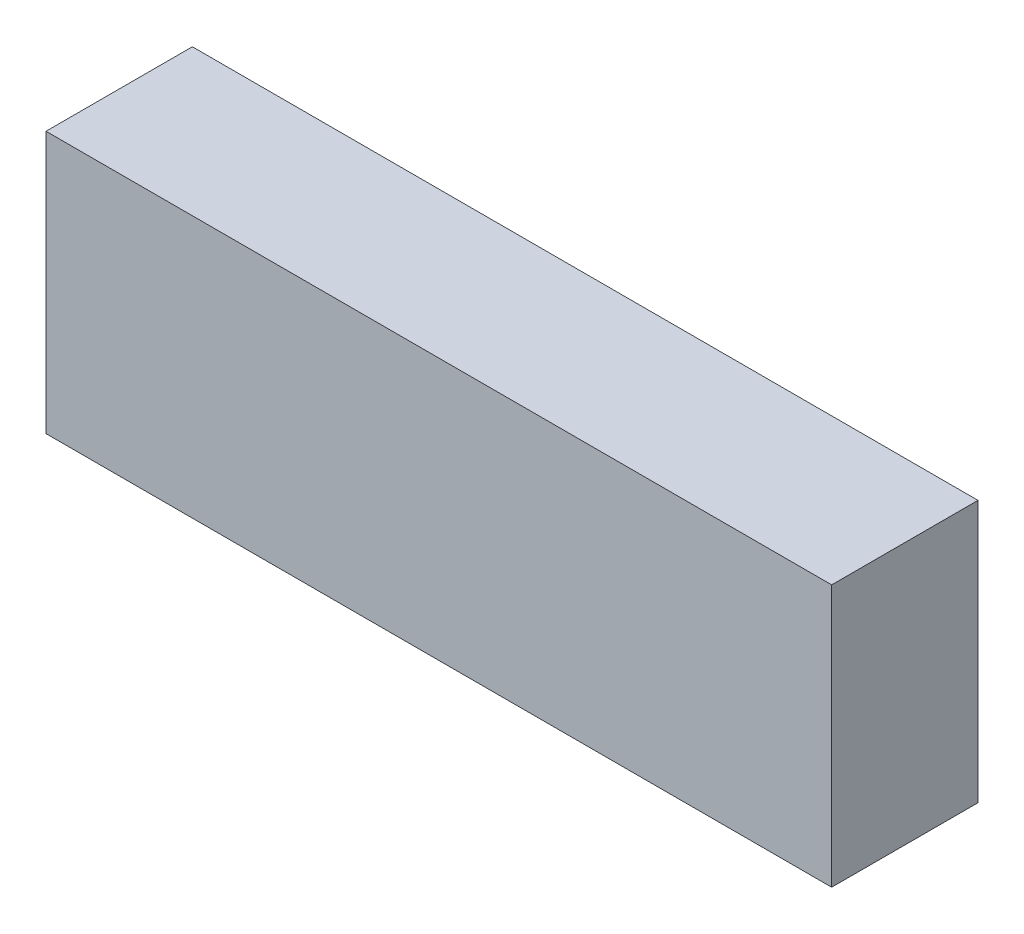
ISO-10303-21;
HEADER;
FILE_DESCRIPTION(('STEP AP214'),'2;1');
FILE_NAME('part.step','',(''),(''),'','','');
FILE_SCHEMA(('AUTOMOTIVE_DESIGN { 1 0 10303 214 1 1 1 1 }'));
ENDSEC;
DATA;
#1=APPLICATION_CONTEXT('core data for automotive mechanical design processes');
#2=APPLICATION_PROTOCOL_DEFINITION('international standard','automotive_design',2000,#1);
#3=PRODUCT_CONTEXT('',#1,'mechanical');
#4=PRODUCT('Part','Part','',(#3));
#5=PRODUCT_RELATED_PRODUCT_CATEGORY('part','',(#4));
#6=PRODUCT_DEFINITION_FORMATION('','',#4);
#7=PRODUCT_DEFINITION_CONTEXT('part definition',#1,'design');
#8=PRODUCT_DEFINITION('design','',#6,#7);
#9=PRODUCT_DEFINITION_SHAPE('','',#8);
#10=(LENGTH_UNIT() NAMED_UNIT(*) SI_UNIT(.MILLI.,.METRE.));
#11=(NAMED_UNIT(*) PLANE_ANGLE_UNIT() SI_UNIT($,.RADIAN.));
#12=(NAMED_UNIT(*) SI_UNIT($,.STERADIAN.) SOLID_ANGLE_UNIT());
#13=UNCERTAINTY_MEASURE_WITH_UNIT(LENGTH_MEASURE(1.E-05),#10,'distance_accuracy_value','');
#14=(GEOMETRIC_REPRESENTATION_CONTEXT(3) GLOBAL_UNCERTAINTY_ASSIGNED_CONTEXT((#13)) GLOBAL_UNIT_ASSIGNED_CONTEXT((#10,
#11,#12)) REPRESENTATION_CONTEXT('',''));
#15=CARTESIAN_POINT('',(0.,0.,0.));
#16=DIRECTION('',(0.,0.,1.));
#17=DIRECTION('',(1.,0.,0.));
#18=AXIS2_PLACEMENT_3D('',#15,#16,#17);
#19=CARTESIAN_POINT('',(-15.,-5.,5.588));
#20=DIRECTION('',(0.,1.,0.));
#21=DIRECTION('',(0.,0.,1.));
#22=AXIS2_PLACEMENT_3D('',#19,#20,#21);
#23=PLANE('',#22);
#24=DIRECTION('',(1.,0.,0.));
#25=VECTOR('',#24,1.);
#26=CARTESIAN_POINT('',(-15.,-5.,0.));
#27=LINE('',#26,#25);
#28=CARTESIAN_POINT('',(-15.,-5.,0.));
#29=VERTEX_POINT('',#28);
#30=CARTESIAN_POINT('',(15.,-5.,0.));
#31=VERTEX_POINT('',#30);
#32=EDGE_CURVE('E99',#29,#31,#27,.T.);
#33=ORIENTED_EDGE('',*,*,#32,.T.);
#34=DIRECTION('',(0.,0.,-1.));
#35=VECTOR('',#34,1.);
#36=CARTESIAN_POINT('',(15.,-5.,5.588));
#37=LINE('',#36,#35);
#38=CARTESIAN_POINT('',(15.,-5.,5.588));
#39=VERTEX_POINT('',#38);
#40=EDGE_CURVE('E11',#39,#31,#37,.T.);
#41=ORIENTED_EDGE('',*,*,#40,.F.);
#42=DIRECTION('',(1.,0.,0.));
#43=VECTOR('',#42,1.);
#44=CARTESIAN_POINT('',(-15.,-5.,5.588));
#45=LINE('',#44,#43);
#46=CARTESIAN_POINT('',(-15.,-5.,5.588));
#47=VERTEX_POINT('',#46);
#48=EDGE_CURVE('E87',#47,#39,#45,.T.);
#49=ORIENTED_EDGE('',*,*,#48,.F.);
#50=DIRECTION('',(0.,0.,-1.));
#51=VECTOR('',#50,1.);
#52=CARTESIAN_POINT('',(-15.,-5.,5.588));
#53=LINE('',#52,#51);
#54=EDGE_CURVE('E95',#47,#29,#53,.T.);
#55=ORIENTED_EDGE('',*,*,#54,.T.);
#56=EDGE_LOOP('',(#33,#41,#49,#55));
#57=FACE_BOUND('',#56,.T.);
#58=ADVANCED_FACE('F36',(#57),#23,.F.);
#59=CARTESIAN_POINT('',(15.,-5.,5.588));
#60=DIRECTION('',(-1.,0.,0.));
#61=DIRECTION('',(0.,0.,1.));
#62=AXIS2_PLACEMENT_3D('',#59,#60,#61);
#63=PLANE('',#62);
#64=DIRECTION('',(0.,1.,0.));
#65=VECTOR('',#64,1.);
#66=CARTESIAN_POINT('',(15.,-5.,0.));
#67=LINE('',#66,#65);
#68=CARTESIAN_POINT('',(15.,5.,0.));
#69=VERTEX_POINT('',#68);
#70=EDGE_CURVE('E91',#31,#69,#67,.T.);
#71=ORIENTED_EDGE('',*,*,#70,.T.);
#72=DIRECTION('',(0.,0.,-1.));
#73=VECTOR('',#72,1.);
#74=CARTESIAN_POINT('',(15.,5.,5.588));
#75=LINE('',#74,#73);
#76=CARTESIAN_POINT('',(15.,5.,5.588));
#77=VERTEX_POINT('',#76);
#78=EDGE_CURVE('E44',#77,#69,#75,.T.);
#79=ORIENTED_EDGE('',*,*,#78,.F.);
#80=DIRECTION('',(0.,1.,0.));
#81=VECTOR('',#80,1.);
#82=CARTESIAN_POINT('',(15.,-5.,5.588));
#83=LINE('',#82,#81);
#84=EDGE_CURVE('E82',#39,#77,#83,.T.);
#85=ORIENTED_EDGE('',*,*,#84,.F.);
#86=ORIENTED_EDGE('',*,*,#40,.T.);
#87=EDGE_LOOP('',(#71,#79,#85,#86));
#88=FACE_BOUND('',#87,.T.);
#89=ADVANCED_FACE('F90',(#88),#63,.F.);
#90=CARTESIAN_POINT('',(15.,5.,5.588));
#91=DIRECTION('',(0.,-1.,0.));
#92=DIRECTION('',(0.,0.,-1.));
#93=AXIS2_PLACEMENT_3D('',#90,#91,#92);
#94=PLANE('',#93);
#95=DIRECTION('',(-1.,0.,0.));
#96=VECTOR('',#95,1.);
#97=CARTESIAN_POINT('',(15.,5.,0.));
#98=LINE('',#97,#96);
#99=CARTESIAN_POINT('',(-15.,5.,0.));
#100=VERTEX_POINT('',#99);
#101=EDGE_CURVE('E69',#69,#100,#98,.T.);
#102=ORIENTED_EDGE('',*,*,#101,.T.);
#103=DIRECTION('',(0.,0.,-1.));
#104=VECTOR('',#103,1.);
#105=CARTESIAN_POINT('',(-15.,5.,5.588));
#106=LINE('',#105,#104);
#107=CARTESIAN_POINT('',(-15.,5.,5.588));
#108=VERTEX_POINT('',#107);
#109=EDGE_CURVE('E92',#108,#100,#106,.T.);
#110=ORIENTED_EDGE('',*,*,#109,.F.);
#111=DIRECTION('',(-1.,0.,0.));
#112=VECTOR('',#111,1.);
#113=CARTESIAN_POINT('',(15.,5.,5.588));
#114=LINE('',#113,#112);
#115=EDGE_CURVE('E85',#77,#108,#114,.T.);
#116=ORIENTED_EDGE('',*,*,#115,.F.);
#117=ORIENTED_EDGE('',*,*,#78,.T.);
#118=EDGE_LOOP('',(#102,#110,#116,#117));
#119=FACE_BOUND('',#118,.T.);
#120=ADVANCED_FACE('F93',(#119),#94,.F.);
#121=CARTESIAN_POINT('',(-15.,5.,5.588));
#122=DIRECTION('',(1.,0.,0.));
#123=DIRECTION('',(0.,0.,-1.));
#124=AXIS2_PLACEMENT_3D('',#121,#122,#123);
#125=PLANE('',#124);
#126=DIRECTION('',(0.,-1.,0.));
#127=VECTOR('',#126,1.);
#128=CARTESIAN_POINT('',(-15.,5.,0.));
#129=LINE('',#128,#127);
#130=EDGE_CURVE('E75',#100,#29,#129,.T.);
#131=ORIENTED_EDGE('',*,*,#130,.T.);
#132=ORIENTED_EDGE('',*,*,#54,.F.);
#133=DIRECTION('',(0.,-1.,0.));
#134=VECTOR('',#133,1.);
#135=CARTESIAN_POINT('',(-15.,5.,5.588));
#136=LINE('',#135,#134);
#137=EDGE_CURVE('E52',#108,#47,#136,.T.);
#138=ORIENTED_EDGE('',*,*,#137,.F.);
#139=ORIENTED_EDGE('',*,*,#109,.T.);
#140=EDGE_LOOP('',(#131,#132,#138,#139));
#141=FACE_BOUND('',#140,.T.);
#142=ADVANCED_FACE('F106',(#141),#125,.F.);
#143=CARTESIAN_POINT('',(15.,-5.,5.588));
#144=DIRECTION('',(0.,0.,1.));
#145=DIRECTION('',(1.,0.,0.));
#146=AXIS2_PLACEMENT_3D('',#143,#144,#145);
#147=PLANE('',#146);
#148=ORIENTED_EDGE('',*,*,#48,.T.);
#149=ORIENTED_EDGE('',*,*,#84,.T.);
#150=ORIENTED_EDGE('',*,*,#115,.T.);
#151=ORIENTED_EDGE('',*,*,#137,.T.);
#152=EDGE_LOOP('',(#148,#149,#150,#151));
#153=FACE_BOUND('',#152,.T.);
#154=ADVANCED_FACE('F83',(#153),#147,.T.);
#155=CARTESIAN_POINT('',(15.,-5.,0.));
#156=DIRECTION('',(0.,0.,1.));
#157=DIRECTION('',(1.,0.,0.));
#158=AXIS2_PLACEMENT_3D('',#155,#156,#157);
#159=PLANE('',#158);
#160=ORIENTED_EDGE('',*,*,#32,.F.);
#161=ORIENTED_EDGE('',*,*,#130,.F.);
#162=ORIENTED_EDGE('',*,*,#101,.F.);
#163=ORIENTED_EDGE('',*,*,#70,.F.);
#164=EDGE_LOOP('',(#160,#161,#162,#163));
#165=FACE_BOUND('',#164,.T.);
#166=ADVANCED_FACE('F109',(#165),#159,.F.);
#167=CLOSED_SHELL('',(#58,#89,#120,#142,#154,#166));
#168=MANIFOLD_SOLID_BREP('B2',#167);
#169=ADVANCED_BREP_SHAPE_REPRESENTATION('',(#18,#168),#14);
#170=SHAPE_DEFINITION_REPRESENTATION(#9,#169);
ENDSEC;
END-ISO-10303-21;
